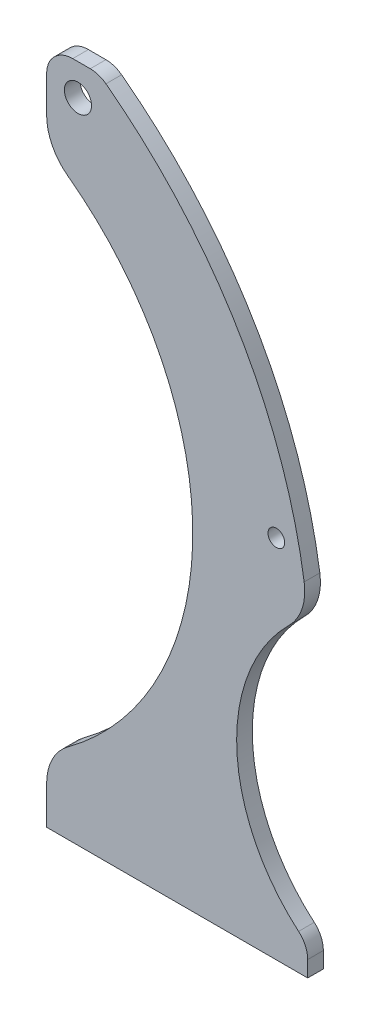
from build123d import *

# Parameters (mm, degrees)
ESQUISSE1_W             = 50
ESQUISSE1_H             = 130
EXTRUSION1_DEPTH        = 3
ESQUISSE3_R             = 2.6
ESQUISSE3_R_2           = 1.6
ENL_V_MAT_EXTRU_1_DEPTH = 6
ENL_V_MAT_EXTRU_2_DEPTH = 20
CONG_1_R                = 10
CONG_2_R                = 5


with BuildPart() as part:
    # Esquisse1 → Extrusion1 (new body)
    with BuildSketch(Plane.XY):
        with Locations((-2.937764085, -11.025)):
            Rectangle(ESQUISSE1_W, ESQUISSE1_H)
    extrude(amount=EXTRUSION1_DEPTH)

    # Esquisse3 → Enl_v. mat.-Extru.1 (cut)
    with BuildSketch(Plane.XY.offset(3)):
        with Locations((-21.937764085, 47.975)):
            Circle(ESQUISSE3_R)
        with Locations((16.062235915, -6.025)):
            Circle(ESQUISSE3_R_2)
        Polygon((-7.937764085, 53.975), (22.062235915, 3.975), (22.062235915, 53.975), align=None)
    extrude(amount=-ENL_V_MAT_EXTRU_1_DEPTH, mode=Mode.SUBTRACT)

    # Esquisse4 → Enl_v. mat.-Extru.2 (cut)
    with BuildSketch(Plane.XY.offset(3)):
        with BuildLine():
            Line((-27.937764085, 36.785641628), (-27.937764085, -63.408020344))
            ThreePointArc((-27.937764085, -63.408020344), (0.051382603, -13.311189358), (-27.937764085, 36.785641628))
        make_face()
        with BuildLine():
            Line((-17.937764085, 53.975), (9.122584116, 53.975))
            Line((9.122584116, 53.975), (35.098718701, 7.628755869))
            Line((35.098718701, 7.628755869), (22.062235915, -70.564710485))
            ThreePointArc((22.062235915, -70.564710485), (8.455247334, -43.39579421), (22.062235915, -16.226877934))
            ThreePointArc((22.062235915, -16.226877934), (9.650339, 23.197650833), (-17.937764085, 53.975))
        make_face()
    extrude(amount=-ENL_V_MAT_EXTRU_2_DEPTH, mode=Mode.SUBTRACT)

    # Cong_1
    cong_1_edges = [part.edges().sort_by_distance(p)[0] for p in [
        (-27.937764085, 36.785641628, 1.5),
        (-27.937764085, -63.408020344, 1.5),
        (22.062235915, -16.226877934, 1.5),
    ]]
    fillet(cong_1_edges, radius=CONG_1_R)

    # Cong_2
    cong_2_edges = [part.edges().sort_by_distance(p)[0] for p in [
        (22.062235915, -70.564710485, 1.5),
        (-17.937764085, 53.975, 1.5),
        (-27.937764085, 53.975, 1.5),
    ]]
    fillet(cong_2_edges, radius=CONG_2_R)


solid = part.part
